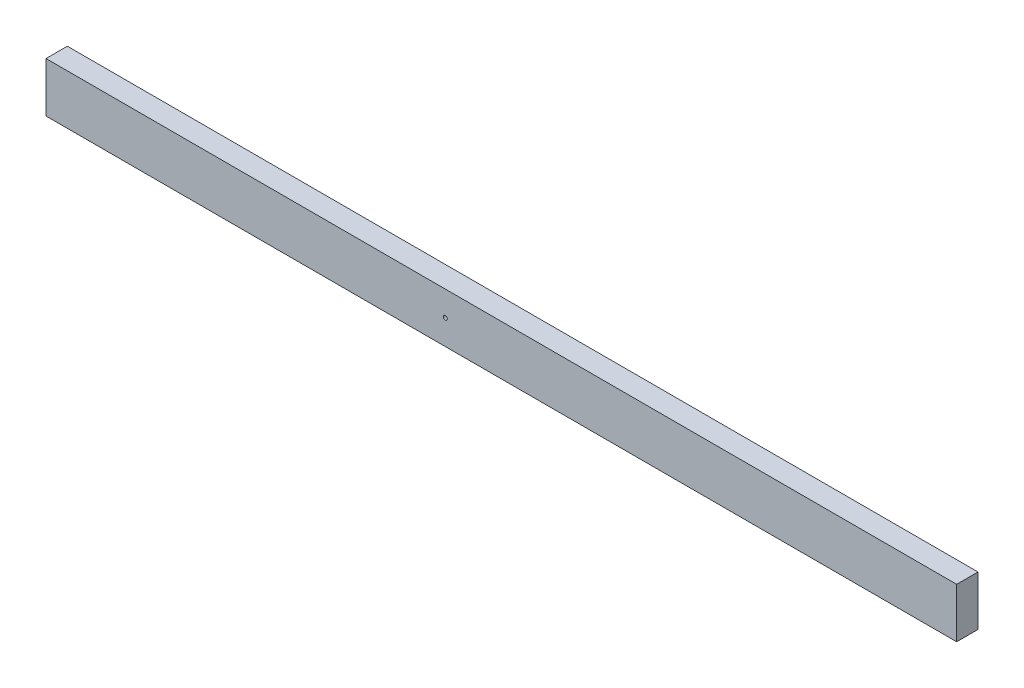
from build123d import *

# Parameters (mm, degrees)
SKETCH1_W                       = 38.1
SKETCH1_H                       = 88.9
BOSS_EXTRUDE1_DEPTH             = 1625.6
F_9_32_0_28125_DIAMETER_HOLE1_D = 7.14375


with BuildPart() as part:
    # Sketch1 → Boss-Extrude1 (new body)
    with BuildSketch(Plane(origin=(0, 0, 0), x_dir=(0, 0, -1), z_dir=(1, 0, 0))):
        Rectangle(SKETCH1_W, SKETCH1_H)
    extrude(amount=BOSS_EXTRUDE1_DEPTH)

    # 9_32 _0.28125_ Diameter Hole1 (through all)
    with Locations(Plane.XY.offset(19.05)):
        with Locations((712.7875, 0)):
            Hole(F_9_32_0_28125_DIAMETER_HOLE1_D / 2)


solid = part.part
